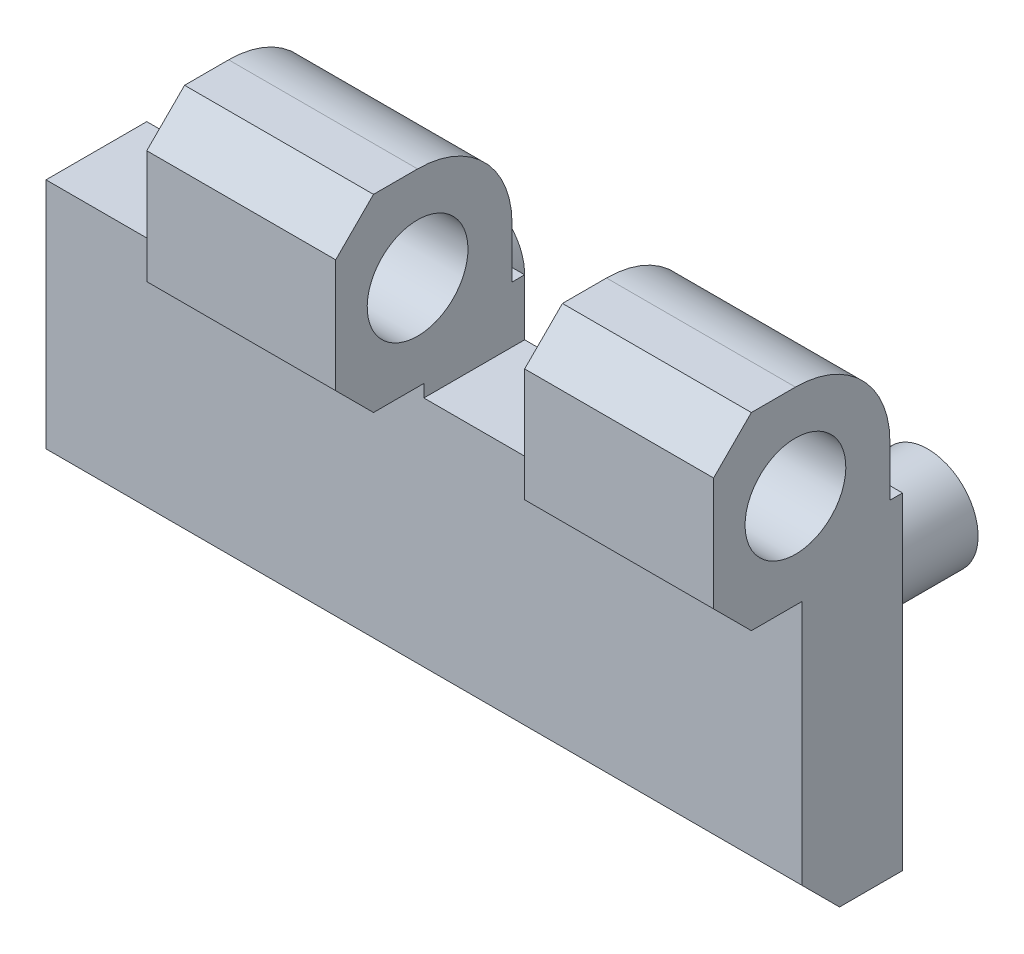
ISO-10303-21;
HEADER;
FILE_DESCRIPTION(('STEP AP214'),'2;1');
FILE_NAME('part.step','',(''),(''),'','','');
FILE_SCHEMA(('AUTOMOTIVE_DESIGN { 1 0 10303 214 1 1 1 1 }'));
ENDSEC;
DATA;
#1=APPLICATION_CONTEXT('core data for automotive mechanical design processes');
#2=APPLICATION_PROTOCOL_DEFINITION('international standard','automotive_design',2000,#1);
#3=PRODUCT_CONTEXT('',#1,'mechanical');
#4=PRODUCT('Part','Part','',(#3));
#5=PRODUCT_RELATED_PRODUCT_CATEGORY('part','',(#4));
#6=PRODUCT_DEFINITION_FORMATION('','',#4);
#7=PRODUCT_DEFINITION_CONTEXT('part definition',#1,'design');
#8=PRODUCT_DEFINITION('design','',#6,#7);
#9=PRODUCT_DEFINITION_SHAPE('','',#8);
#10=(LENGTH_UNIT() NAMED_UNIT(*) SI_UNIT(.MILLI.,.METRE.));
#11=(NAMED_UNIT(*) PLANE_ANGLE_UNIT() SI_UNIT($,.RADIAN.));
#12=(NAMED_UNIT(*) SI_UNIT($,.STERADIAN.) SOLID_ANGLE_UNIT());
#13=UNCERTAINTY_MEASURE_WITH_UNIT(LENGTH_MEASURE(1.E-05),#10,'distance_accuracy_value','');
#14=(GEOMETRIC_REPRESENTATION_CONTEXT(3) GLOBAL_UNCERTAINTY_ASSIGNED_CONTEXT((#13)) GLOBAL_UNIT_ASSIGNED_CONTEXT((#10,
#11,#12)) REPRESENTATION_CONTEXT('',''));
#15=CARTESIAN_POINT('',(0.,0.,0.));
#16=DIRECTION('',(0.,0.,1.));
#17=DIRECTION('',(1.,0.,0.));
#18=AXIS2_PLACEMENT_3D('',#15,#16,#17);
#19=CARTESIAN_POINT('',(-12.,-12.,0.));
#20=DIRECTION('',(0.,0.,-1.));
#21=DIRECTION('',(-1.,0.,0.));
#22=AXIS2_PLACEMENT_3D('',#19,#20,#21);
#23=PLANE('',#22);
#24=DIRECTION('',(-1.,0.,0.));
#25=VECTOR('',#24,1.);
#26=CARTESIAN_POINT('',(-12.,9.5,0.));
#27=LINE('',#26,#25);
#28=CARTESIAN_POINT('',(33.,9.5,0.));
#29=VERTEX_POINT('',#28);
#30=CARTESIAN_POINT('',(18.,9.5,0.));
#31=VERTEX_POINT('',#30);
#32=EDGE_CURVE('E18',#29,#31,#27,.T.);
#33=ORIENTED_EDGE('',*,*,#32,.F.);
#34=DIRECTION('',(0.,1.,0.));
#35=VECTOR('',#34,1.);
#36=CARTESIAN_POINT('',(33.,-12.,0.));
#37=LINE('',#36,#35);
#38=CARTESIAN_POINT('',(33.,13.97,0.));
#39=VERTEX_POINT('',#38);
#40=EDGE_CURVE('E214',#29,#39,#37,.T.);
#41=ORIENTED_EDGE('',*,*,#40,.T.);
#42=DIRECTION('',(1.,0.,0.));
#43=VECTOR('',#42,1.);
#44=CARTESIAN_POINT('',(-12.,13.97,0.));
#45=LINE('',#44,#43);
#46=CARTESIAN_POINT('',(48.,13.97,0.));
#47=VERTEX_POINT('',#46);
#48=EDGE_CURVE('E259',#39,#47,#45,.T.);
#49=ORIENTED_EDGE('',*,*,#48,.T.);
#50=DIRECTION('',(0.,1.,0.));
#51=VECTOR('',#50,1.);
#52=CARTESIAN_POINT('',(48.,-12.,0.));
#53=LINE('',#52,#51);
#54=CARTESIAN_POINT('',(48.,-12.,0.));
#55=VERTEX_POINT('',#54);
#56=EDGE_CURVE('E247',#55,#47,#53,.T.);
#57=ORIENTED_EDGE('',*,*,#56,.F.);
#58=DIRECTION('',(1.,0.,0.));
#59=VECTOR('',#58,1.);
#60=CARTESIAN_POINT('',(-12.,-12.,0.));
#61=LINE('',#60,#59);
#62=CARTESIAN_POINT('',(-12.,-12.,0.));
#63=VERTEX_POINT('',#62);
#64=EDGE_CURVE('E257',#63,#55,#61,.T.);
#65=ORIENTED_EDGE('',*,*,#64,.F.);
#66=DIRECTION('',(0.,1.,0.));
#67=VECTOR('',#66,1.);
#68=CARTESIAN_POINT('',(-12.,-12.,0.));
#69=LINE('',#68,#67);
#70=CARTESIAN_POINT('',(-12.,9.5,0.));
#71=VERTEX_POINT('',#70);
#72=EDGE_CURVE('E208',#63,#71,#69,.T.);
#73=ORIENTED_EDGE('',*,*,#72,.T.);
#74=DIRECTION('',(-1.,0.,0.));
#75=VECTOR('',#74,1.);
#76=CARTESIAN_POINT('',(-12.,9.5,0.));
#77=LINE('',#76,#75);
#78=CARTESIAN_POINT('',(3.,9.5,0.));
#79=VERTEX_POINT('',#78);
#80=EDGE_CURVE('E197',#79,#71,#77,.T.);
#81=ORIENTED_EDGE('',*,*,#80,.F.);
#82=DIRECTION('',(0.,1.,0.));
#83=VECTOR('',#82,1.);
#84=CARTESIAN_POINT('',(3.,-12.,0.));
#85=LINE('',#84,#83);
#86=CARTESIAN_POINT('',(3.,13.97,0.));
#87=VERTEX_POINT('',#86);
#88=EDGE_CURVE('E181',#79,#87,#85,.T.);
#89=ORIENTED_EDGE('',*,*,#88,.T.);
#90=CARTESIAN_POINT('',(18.,13.97,0.));
#91=VERTEX_POINT('',#90);
#92=EDGE_CURVE('E261',#87,#91,#45,.T.);
#93=ORIENTED_EDGE('',*,*,#92,.T.);
#94=DIRECTION('',(0.,1.,0.));
#95=VECTOR('',#94,1.);
#96=CARTESIAN_POINT('',(18.,-12.,0.));
#97=LINE('',#96,#95);
#98=EDGE_CURVE('E319',#31,#91,#97,.T.);
#99=ORIENTED_EDGE('',*,*,#98,.F.);
#100=EDGE_LOOP('',(#33,#41,#49,#57,#65,#73,#81,#89,#93,#99));
#101=FACE_BOUND('',#100,.T.);
#102=CARTESIAN_POINT('',(36.,0.,0.));
#103=DIRECTION('',(0.,0.,-1.));
#104=DIRECTION('',(-1.,0.,0.));
#105=AXIS2_PLACEMENT_3D('',#102,#103,#104);
#106=CIRCLE('',#105,4.);
#107=CARTESIAN_POINT('',(32.,0.,0.));
#108=VERTEX_POINT('',#107);
#109=EDGE_CURVE('E9',#108,#108,#106,.T.);
#110=ORIENTED_EDGE('',*,*,#109,.F.);
#111=EDGE_LOOP('',(#110));
#112=FACE_BOUND('',#111,.T.);
#113=CARTESIAN_POINT('',(0.,0.,0.));
#114=DIRECTION('',(0.,0.,-1.));
#115=DIRECTION('',(-1.,0.,0.));
#116=AXIS2_PLACEMENT_3D('',#113,#114,#115);
#117=CIRCLE('',#116,4.);
#118=CARTESIAN_POINT('',(-4.,0.,0.));
#119=VERTEX_POINT('',#118);
#120=EDGE_CURVE('E489',#119,#119,#117,.T.);
#121=ORIENTED_EDGE('',*,*,#120,.F.);
#122=EDGE_LOOP('',(#121));
#123=FACE_BOUND('',#122,.T.);
#124=ADVANCED_FACE('F14',(#101,#112,#123),#23,.T.);
#125=CARTESIAN_POINT('',(-12.,-12.,8.));
#126=DIRECTION('',(0.,0.,-1.));
#127=DIRECTION('',(0.,1.,0.));
#128=AXIS2_PLACEMENT_3D('',#125,#126,#127);
#129=PLANE('',#128);
#130=DIRECTION('',(0.,1.,0.));
#131=VECTOR('',#130,1.);
#132=CARTESIAN_POINT('',(33.,-12.,8.));
#133=LINE('',#132,#131);
#134=CARTESIAN_POINT('',(33.,9.5,8.));
#135=VERTEX_POINT('',#134);
#136=CARTESIAN_POINT('',(33.,10.5,8.));
#137=VERTEX_POINT('',#136);
#138=EDGE_CURVE('E345',#135,#137,#133,.T.);
#139=ORIENTED_EDGE('',*,*,#138,.F.);
#140=DIRECTION('',(-1.,0.,0.));
#141=VECTOR('',#140,1.);
#142=CARTESIAN_POINT('',(-12.,9.5,8.));
#143=LINE('',#142,#141);
#144=CARTESIAN_POINT('',(18.,9.5,8.));
#145=VERTEX_POINT('',#144);
#146=EDGE_CURVE('E211',#135,#145,#143,.T.);
#147=ORIENTED_EDGE('',*,*,#146,.T.);
#148=DIRECTION('',(0.,1.,0.));
#149=VECTOR('',#148,1.);
#150=CARTESIAN_POINT('',(18.,-12.,8.));
#151=LINE('',#150,#149);
#152=CARTESIAN_POINT('',(18.,10.5,8.));
#153=VERTEX_POINT('',#152);
#154=EDGE_CURVE('E322',#145,#153,#151,.T.);
#155=ORIENTED_EDGE('',*,*,#154,.T.);
#156=DIRECTION('',(1.,0.,0.));
#157=VECTOR('',#156,1.);
#158=CARTESIAN_POINT('',(-12.,10.5,8.));
#159=LINE('',#158,#157);
#160=CARTESIAN_POINT('',(3.,10.5,8.));
#161=VERTEX_POINT('',#160);
#162=EDGE_CURVE('E273',#161,#153,#159,.T.);
#163=ORIENTED_EDGE('',*,*,#162,.F.);
#164=DIRECTION('',(0.,1.,0.));
#165=VECTOR('',#164,1.);
#166=CARTESIAN_POINT('',(3.,-12.,8.));
#167=LINE('',#166,#165);
#168=CARTESIAN_POINT('',(3.,9.5,8.));
#169=VERTEX_POINT('',#168);
#170=EDGE_CURVE('E470',#169,#161,#167,.T.);
#171=ORIENTED_EDGE('',*,*,#170,.F.);
#172=DIRECTION('',(-1.,0.,0.));
#173=VECTOR('',#172,1.);
#174=CARTESIAN_POINT('',(-12.,9.5,8.));
#175=LINE('',#174,#173);
#176=CARTESIAN_POINT('',(-12.,9.5,8.));
#177=VERTEX_POINT('',#176);
#178=EDGE_CURVE('E200',#169,#177,#175,.T.);
#179=ORIENTED_EDGE('',*,*,#178,.T.);
#180=DIRECTION('',(0.,1.,0.));
#181=VECTOR('',#180,1.);
#182=CARTESIAN_POINT('',(-12.,-12.,8.));
#183=LINE('',#182,#181);
#184=CARTESIAN_POINT('',(-12.,-9.,8.));
#185=VERTEX_POINT('',#184);
#186=EDGE_CURVE('E253',#185,#177,#183,.T.);
#187=ORIENTED_EDGE('',*,*,#186,.F.);
#188=DIRECTION('',(1.,0.,0.));
#189=VECTOR('',#188,1.);
#190=CARTESIAN_POINT('',(-12.,-9.,8.));
#191=LINE('',#190,#189);
#192=CARTESIAN_POINT('',(48.,-9.,8.));
#193=VERTEX_POINT('',#192);
#194=EDGE_CURVE('E274',#185,#193,#191,.T.);
#195=ORIENTED_EDGE('',*,*,#194,.T.);
#196=DIRECTION('',(0.,1.,0.));
#197=VECTOR('',#196,1.);
#198=CARTESIAN_POINT('',(48.,-12.,8.));
#199=LINE('',#198,#197);
#200=CARTESIAN_POINT('',(48.,10.5,8.));
#201=VERTEX_POINT('',#200);
#202=EDGE_CURVE('E226',#193,#201,#199,.T.);
#203=ORIENTED_EDGE('',*,*,#202,.T.);
#204=EDGE_CURVE('E271',#137,#201,#159,.T.);
#205=ORIENTED_EDGE('',*,*,#204,.F.);
#206=EDGE_LOOP('',(#139,#147,#155,#163,#171,#179,#187,#195,#203,#205));
#207=FACE_BOUND('',#206,.T.);
#208=ADVANCED_FACE('F16',(#207),#129,.F.);
#209=CARTESIAN_POINT('',(-12.,10.5,15.));
#210=DIRECTION('',(0.,-1.,0.));
#211=DIRECTION('',(0.,0.,-1.));
#212=AXIS2_PLACEMENT_3D('',#209,#210,#211);
#213=PLANE('',#212);
#214=DIRECTION('',(-1.,0.,0.));
#215=VECTOR('',#214,1.);
#216=CARTESIAN_POINT('',(-12.,10.5,12.));
#217=LINE('',#216,#215);
#218=CARTESIAN_POINT('',(48.,10.5,12.));
#219=VERTEX_POINT('',#218);
#220=CARTESIAN_POINT('',(33.,10.5,12.));
#221=VERTEX_POINT('',#220);
#222=EDGE_CURVE('E294',#219,#221,#217,.T.);
#223=ORIENTED_EDGE('',*,*,#222,.T.);
#224=DIRECTION('',(0.,0.,-1.));
#225=VECTOR('',#224,1.);
#226=CARTESIAN_POINT('',(33.,10.5,15.));
#227=LINE('',#226,#225);
#228=EDGE_CURVE('E342',#221,#137,#227,.T.);
#229=ORIENTED_EDGE('',*,*,#228,.T.);
#230=ORIENTED_EDGE('',*,*,#204,.T.);
#231=DIRECTION('',(0.,0.,-1.));
#232=VECTOR('',#231,1.);
#233=CARTESIAN_POINT('',(48.,10.5,15.));
#234=LINE('',#233,#232);
#235=EDGE_CURVE('E229',#219,#201,#234,.T.);
#236=ORIENTED_EDGE('',*,*,#235,.F.);
#237=EDGE_LOOP('',(#223,#229,#230,#236));
#238=FACE_BOUND('',#237,.T.);
#239=ADVANCED_FACE('F379',(#238),#213,.T.);
#240=DIRECTION('',(0.,0.,-1.));
#241=VECTOR('',#240,1.);
#242=CARTESIAN_POINT('',(18.,10.5,15.));
#243=LINE('',#242,#241);
#244=CARTESIAN_POINT('',(18.,10.5,12.));
#245=VERTEX_POINT('',#244);
#246=EDGE_CURVE('E454',#245,#153,#243,.T.);
#247=ORIENTED_EDGE('',*,*,#246,.F.);
#248=CARTESIAN_POINT('',(3.,10.5,12.));
#249=VERTEX_POINT('',#248);
#250=EDGE_CURVE('E298',#245,#249,#217,.T.);
#251=ORIENTED_EDGE('',*,*,#250,.T.);
#252=DIRECTION('',(0.,0.,-1.));
#253=VECTOR('',#252,1.);
#254=CARTESIAN_POINT('',(3.,10.5,15.));
#255=LINE('',#254,#253);
#256=EDGE_CURVE('E472',#249,#161,#255,.T.);
#257=ORIENTED_EDGE('',*,*,#256,.T.);
#258=ORIENTED_EDGE('',*,*,#162,.T.);
#259=EDGE_LOOP('',(#247,#251,#257,#258));
#260=FACE_BOUND('',#259,.T.);
#261=ADVANCED_FACE('F568',(#260),#213,.T.);
#262=CARTESIAN_POINT('',(-12.,10.5,15.));
#263=DIRECTION('',(0.,0.,-1.));
#264=DIRECTION('',(0.,1.,0.));
#265=AXIS2_PLACEMENT_3D('',#262,#263,#264);
#266=PLANE('',#265);
#267=DIRECTION('',(0.,1.,0.));
#268=VECTOR('',#267,1.);
#269=CARTESIAN_POINT('',(33.,10.5,15.));
#270=LINE('',#269,#268);
#271=CARTESIAN_POINT('',(33.,13.5,15.));
#272=VERTEX_POINT('',#271);
#273=CARTESIAN_POINT('',(33.,22.5,15.));
#274=VERTEX_POINT('',#273);
#275=EDGE_CURVE('E335',#272,#274,#270,.T.);
#276=ORIENTED_EDGE('',*,*,#275,.F.);
#277=DIRECTION('',(1.,0.,0.));
#278=VECTOR('',#277,1.);
#279=CARTESIAN_POINT('',(48.,13.5,15.));
#280=LINE('',#279,#278);
#281=CARTESIAN_POINT('',(48.,13.5,15.));
#282=VERTEX_POINT('',#281);
#283=EDGE_CURVE('E291',#272,#282,#280,.T.);
#284=ORIENTED_EDGE('',*,*,#283,.T.);
#285=DIRECTION('',(0.,1.,0.));
#286=VECTOR('',#285,1.);
#287=CARTESIAN_POINT('',(48.,10.5,15.));
#288=LINE('',#287,#286);
#289=CARTESIAN_POINT('',(48.,22.5,15.));
#290=VERTEX_POINT('',#289);
#291=EDGE_CURVE('E232',#282,#290,#288,.T.);
#292=ORIENTED_EDGE('',*,*,#291,.T.);
#293=DIRECTION('',(-1.,0.,0.));
#294=VECTOR('',#293,1.);
#295=CARTESIAN_POINT('',(-12.,22.5,15.));
#296=LINE('',#295,#294);
#297=EDGE_CURVE('E288',#290,#274,#296,.T.);
#298=ORIENTED_EDGE('',*,*,#297,.T.);
#299=EDGE_LOOP('',(#276,#284,#292,#298));
#300=FACE_BOUND('',#299,.T.);
#301=ADVANCED_FACE('F390',(#300),#266,.F.);
#302=CARTESIAN_POINT('',(3.,13.5,15.));
#303=VERTEX_POINT('',#302);
#304=CARTESIAN_POINT('',(18.,13.5,15.));
#305=VERTEX_POINT('',#304);
#306=EDGE_CURVE('E293',#303,#305,#280,.T.);
#307=ORIENTED_EDGE('',*,*,#306,.T.);
#308=DIRECTION('',(0.,1.,0.));
#309=VECTOR('',#308,1.);
#310=CARTESIAN_POINT('',(18.,10.5,15.));
#311=LINE('',#310,#309);
#312=CARTESIAN_POINT('',(18.,22.5,15.));
#313=VERTEX_POINT('',#312);
#314=EDGE_CURVE('E462',#305,#313,#311,.T.);
#315=ORIENTED_EDGE('',*,*,#314,.T.);
#316=CARTESIAN_POINT('',(3.,22.5,15.));
#317=VERTEX_POINT('',#316);
#318=EDGE_CURVE('E287',#313,#317,#296,.T.);
#319=ORIENTED_EDGE('',*,*,#318,.T.);
#320=DIRECTION('',(0.,1.,0.));
#321=VECTOR('',#320,1.);
#322=CARTESIAN_POINT('',(3.,10.5,15.));
#323=LINE('',#322,#321);
#324=EDGE_CURVE('E38',#303,#317,#323,.T.);
#325=ORIENTED_EDGE('',*,*,#324,.F.);
#326=EDGE_LOOP('',(#307,#315,#319,#325));
#327=FACE_BOUND('',#326,.T.);
#328=ADVANCED_FACE('F560',(#327),#266,.F.);
#329=CARTESIAN_POINT('',(-12.,25.5,15.));
#330=DIRECTION('',(0.,-1.,0.));
#331=DIRECTION('',(0.,0.,-1.));
#332=AXIS2_PLACEMENT_3D('',#329,#330,#331);
#333=PLANE('',#332);
#334=DIRECTION('',(0.,0.,-1.));
#335=VECTOR('',#334,1.);
#336=CARTESIAN_POINT('',(33.,25.5,15.));
#337=LINE('',#336,#335);
#338=CARTESIAN_POINT('',(33.,25.5,12.));
#339=VERTEX_POINT('',#338);
#340=CARTESIAN_POINT('',(33.,25.5,8.5));
#341=VERTEX_POINT('',#340);
#342=EDGE_CURVE('E328',#339,#341,#337,.T.);
#343=ORIENTED_EDGE('',*,*,#342,.F.);
#344=DIRECTION('',(1.,0.,0.));
#345=VECTOR('',#344,1.);
#346=CARTESIAN_POINT('',(-12.,25.5,12.));
#347=LINE('',#346,#345);
#348=CARTESIAN_POINT('',(48.,25.5,12.));
#349=VERTEX_POINT('',#348);
#350=EDGE_CURVE('E297',#339,#349,#347,.T.);
#351=ORIENTED_EDGE('',*,*,#350,.T.);
#352=DIRECTION('',(0.,0.,-1.));
#353=VECTOR('',#352,1.);
#354=CARTESIAN_POINT('',(48.,25.5,15.));
#355=LINE('',#354,#353);
#356=CARTESIAN_POINT('',(48.,25.5,8.5));
#357=VERTEX_POINT('',#356);
#358=EDGE_CURVE('E235',#349,#357,#355,.T.);
#359=ORIENTED_EDGE('',*,*,#358,.T.);
#360=DIRECTION('',(1.,0.,0.));
#361=VECTOR('',#360,1.);
#362=CARTESIAN_POINT('',(-12.,25.5,8.5));
#363=LINE('',#362,#361);
#364=EDGE_CURVE('E268',#341,#357,#363,.T.);
#365=ORIENTED_EDGE('',*,*,#364,.F.);
#366=EDGE_LOOP('',(#343,#351,#359,#365));
#367=FACE_BOUND('',#366,.T.);
#368=ADVANCED_FACE('F399',(#367),#333,.F.);
#369=CARTESIAN_POINT('',(3.,25.5,12.));
#370=VERTEX_POINT('',#369);
#371=CARTESIAN_POINT('',(18.,25.5,12.));
#372=VERTEX_POINT('',#371);
#373=EDGE_CURVE('E300',#370,#372,#347,.T.);
#374=ORIENTED_EDGE('',*,*,#373,.T.);
#375=DIRECTION('',(0.,0.,-1.));
#376=VECTOR('',#375,1.);
#377=CARTESIAN_POINT('',(18.,25.5,15.));
#378=LINE('',#377,#376);
#379=CARTESIAN_POINT('',(18.,25.5,8.5));
#380=VERTEX_POINT('',#379);
#381=EDGE_CURVE('E30',#372,#380,#378,.T.);
#382=ORIENTED_EDGE('',*,*,#381,.T.);
#383=CARTESIAN_POINT('',(3.,25.5,8.5));
#384=VERTEX_POINT('',#383);
#385=EDGE_CURVE('E270',#384,#380,#363,.T.);
#386=ORIENTED_EDGE('',*,*,#385,.F.);
#387=DIRECTION('',(0.,0.,-1.));
#388=VECTOR('',#387,1.);
#389=CARTESIAN_POINT('',(3.,25.5,15.));
#390=LINE('',#389,#388);
#391=EDGE_CURVE('E481',#370,#384,#390,.T.);
#392=ORIENTED_EDGE('',*,*,#391,.F.);
#393=EDGE_LOOP('',(#374,#382,#386,#392));
#394=FACE_BOUND('',#393,.T.);
#395=ADVANCED_FACE('F554',(#394),#333,.F.);
#396=CARTESIAN_POINT('',(-12.,18.,8.5));
#397=DIRECTION('',(1.,0.,0.));
#398=DIRECTION('',(0.,1.,0.));
#399=AXIS2_PLACEMENT_3D('',#396,#397,#398);
#400=CYLINDRICAL_SURFACE('',#399,7.5);
#401=CARTESIAN_POINT('',(33.,18.,8.5));
#402=DIRECTION('',(-1.,0.,0.));
#403=DIRECTION('',(0.,-1.,0.));
#404=AXIS2_PLACEMENT_3D('',#401,#402,#403);
#405=CIRCLE('',#404,7.5);
#406=CARTESIAN_POINT('',(33.,18.,1.));
#407=VERTEX_POINT('',#406);
#408=EDGE_CURVE('E340',#341,#407,#405,.T.);
#409=ORIENTED_EDGE('',*,*,#408,.F.);
#410=ORIENTED_EDGE('',*,*,#364,.T.);
#411=CARTESIAN_POINT('',(48.,18.,8.5));
#412=DIRECTION('',(-1.,0.,0.));
#413=DIRECTION('',(0.,-1.,0.));
#414=AXIS2_PLACEMENT_3D('',#411,#412,#413);
#415=CIRCLE('',#414,7.5);
#416=CARTESIAN_POINT('',(48.,18.,1.));
#417=VERTEX_POINT('',#416);
#418=EDGE_CURVE('E238',#357,#417,#415,.T.);
#419=ORIENTED_EDGE('',*,*,#418,.T.);
#420=DIRECTION('',(1.,0.,0.));
#421=VECTOR('',#420,1.);
#422=CARTESIAN_POINT('',(-12.,18.,1.));
#423=LINE('',#422,#421);
#424=EDGE_CURVE('E265',#407,#417,#423,.T.);
#425=ORIENTED_EDGE('',*,*,#424,.F.);
#426=EDGE_LOOP('',(#409,#410,#419,#425));
#427=FACE_BOUND('',#426,.T.);
#428=ADVANCED_FACE('F406',(#427),#400,.T.);
#429=ORIENTED_EDGE('',*,*,#385,.T.);
#430=CARTESIAN_POINT('',(18.,18.,8.5));
#431=DIRECTION('',(-1.,0.,0.));
#432=DIRECTION('',(0.,-1.,0.));
#433=AXIS2_PLACEMENT_3D('',#430,#431,#432);
#434=CIRCLE('',#433,7.5);
#435=CARTESIAN_POINT('',(18.,18.,1.));
#436=VERTEX_POINT('',#435);
#437=EDGE_CURVE('E458',#380,#436,#434,.T.);
#438=ORIENTED_EDGE('',*,*,#437,.T.);
#439=CARTESIAN_POINT('',(3.,18.,1.));
#440=VERTEX_POINT('',#439);
#441=EDGE_CURVE('E267',#440,#436,#423,.T.);
#442=ORIENTED_EDGE('',*,*,#441,.F.);
#443=CARTESIAN_POINT('',(3.,18.,8.5));
#444=DIRECTION('',(-1.,0.,0.));
#445=DIRECTION('',(0.,-1.,0.));
#446=AXIS2_PLACEMENT_3D('',#443,#444,#445);
#447=CIRCLE('',#446,7.5);
#448=EDGE_CURVE('E475',#384,#440,#447,.T.);
#449=ORIENTED_EDGE('',*,*,#448,.F.);
#450=EDGE_LOOP('',(#429,#438,#442,#449));
#451=FACE_BOUND('',#450,.T.);
#452=ADVANCED_FACE('F411',(#451),#400,.T.);
#453=CARTESIAN_POINT('',(-12.,18.,1.));
#454=DIRECTION('',(0.,0.,1.));
#455=DIRECTION('',(0.,-1.,0.));
#456=AXIS2_PLACEMENT_3D('',#453,#454,#455);
#457=PLANE('',#456);
#458=DIRECTION('',(0.,-1.,0.));
#459=VECTOR('',#458,1.);
#460=CARTESIAN_POINT('',(33.,18.,1.));
#461=LINE('',#460,#459);
#462=CARTESIAN_POINT('',(33.,13.97,1.));
#463=VERTEX_POINT('',#462);
#464=EDGE_CURVE('E347',#407,#463,#461,.T.);
#465=ORIENTED_EDGE('',*,*,#464,.F.);
#466=ORIENTED_EDGE('',*,*,#424,.T.);
#467=DIRECTION('',(0.,-1.,0.));
#468=VECTOR('',#467,1.);
#469=CARTESIAN_POINT('',(48.,18.,1.));
#470=LINE('',#469,#468);
#471=CARTESIAN_POINT('',(48.,13.97,1.));
#472=VERTEX_POINT('',#471);
#473=EDGE_CURVE('E241',#417,#472,#470,.T.);
#474=ORIENTED_EDGE('',*,*,#473,.T.);
#475=DIRECTION('',(1.,0.,0.));
#476=VECTOR('',#475,1.);
#477=CARTESIAN_POINT('',(-12.,13.97,1.));
#478=LINE('',#477,#476);
#479=EDGE_CURVE('E262',#463,#472,#478,.T.);
#480=ORIENTED_EDGE('',*,*,#479,.F.);
#481=EDGE_LOOP('',(#465,#466,#474,#480));
#482=FACE_BOUND('',#481,.T.);
#483=ADVANCED_FACE('F408',(#482),#457,.F.);
#484=ORIENTED_EDGE('',*,*,#441,.T.);
#485=DIRECTION('',(0.,-1.,0.));
#486=VECTOR('',#485,1.);
#487=CARTESIAN_POINT('',(18.,18.,1.));
#488=LINE('',#487,#486);
#489=CARTESIAN_POINT('',(18.,13.97,1.));
#490=VERTEX_POINT('',#489);
#491=EDGE_CURVE('E330',#436,#490,#488,.T.);
#492=ORIENTED_EDGE('',*,*,#491,.T.);
#493=CARTESIAN_POINT('',(3.,13.97,1.));
#494=VERTEX_POINT('',#493);
#495=EDGE_CURVE('E264',#494,#490,#478,.T.);
#496=ORIENTED_EDGE('',*,*,#495,.F.);
#497=DIRECTION('',(0.,-1.,0.));
#498=VECTOR('',#497,1.);
#499=CARTESIAN_POINT('',(3.,18.,1.));
#500=LINE('',#499,#498);
#501=EDGE_CURVE('E451',#440,#494,#500,.T.);
#502=ORIENTED_EDGE('',*,*,#501,.F.);
#503=EDGE_LOOP('',(#484,#492,#496,#502));
#504=FACE_BOUND('',#503,.T.);
#505=ADVANCED_FACE('F410',(#504),#457,.F.);
#506=CARTESIAN_POINT('',(-12.,13.97,1.));
#507=DIRECTION('',(0.,-1.,0.));
#508=DIRECTION('',(1.,0.,0.));
#509=AXIS2_PLACEMENT_3D('',#506,#507,#508);
#510=PLANE('',#509);
#511=DIRECTION('',(0.,0.,-1.));
#512=VECTOR('',#511,1.);
#513=CARTESIAN_POINT('',(33.,13.97,1.));
#514=LINE('',#513,#512);
#515=EDGE_CURVE('E349',#463,#39,#514,.T.);
#516=ORIENTED_EDGE('',*,*,#515,.F.);
#517=ORIENTED_EDGE('',*,*,#479,.T.);
#518=DIRECTION('',(0.,0.,-1.));
#519=VECTOR('',#518,1.);
#520=CARTESIAN_POINT('',(48.,13.97,1.));
#521=LINE('',#520,#519);
#522=EDGE_CURVE('E244',#472,#47,#521,.T.);
#523=ORIENTED_EDGE('',*,*,#522,.T.);
#524=ORIENTED_EDGE('',*,*,#48,.F.);
#525=EDGE_LOOP('',(#516,#517,#523,#524));
#526=FACE_BOUND('',#525,.T.);
#527=ADVANCED_FACE('F355',(#526),#510,.F.);
#528=ORIENTED_EDGE('',*,*,#495,.T.);
#529=DIRECTION('',(0.,0.,-1.));
#530=VECTOR('',#529,1.);
#531=CARTESIAN_POINT('',(18.,13.97,1.));
#532=LINE('',#531,#530);
#533=EDGE_CURVE('E325',#490,#91,#532,.T.);
#534=ORIENTED_EDGE('',*,*,#533,.T.);
#535=ORIENTED_EDGE('',*,*,#92,.F.);
#536=DIRECTION('',(0.,0.,-1.));
#537=VECTOR('',#536,1.);
#538=CARTESIAN_POINT('',(3.,13.97,1.));
#539=LINE('',#538,#537);
#540=EDGE_CURVE('E188',#494,#87,#539,.T.);
#541=ORIENTED_EDGE('',*,*,#540,.F.);
#542=EDGE_LOOP('',(#528,#534,#535,#541));
#543=FACE_BOUND('',#542,.T.);
#544=ADVANCED_FACE('F432',(#543),#510,.F.);
#545=CARTESIAN_POINT('',(-12.,18.,8.5));
#546=DIRECTION('',(1.,0.,0.));
#547=DIRECTION('',(0.,1.,0.));
#548=AXIS2_PLACEMENT_3D('',#545,#546,#547);
#549=CYLINDRICAL_SURFACE('',#548,4.);
#550=CARTESIAN_POINT('',(48.,18.,8.5));
#551=DIRECTION('',(1.,0.,0.));
#552=DIRECTION('',(0.,1.,0.));
#553=AXIS2_PLACEMENT_3D('',#550,#551,#552);
#554=CIRCLE('',#553,4.);
#555=CARTESIAN_POINT('',(48.,22.,8.5));
#556=VERTEX_POINT('',#555);
#557=EDGE_CURVE('E220',#556,#556,#554,.T.);
#558=ORIENTED_EDGE('',*,*,#557,.T.);
#559=EDGE_LOOP('',(#558));
#560=FACE_BOUND('',#559,.T.);
#561=CARTESIAN_POINT('',(33.,18.,8.5));
#562=DIRECTION('',(-1.,0.,0.));
#563=DIRECTION('',(0.,-1.,0.));
#564=AXIS2_PLACEMENT_3D('',#561,#562,#563);
#565=CIRCLE('',#564,4.);
#566=CARTESIAN_POINT('',(33.,14.,8.5));
#567=VERTEX_POINT('',#566);
#568=EDGE_CURVE('E209',#567,#567,#565,.F.);
#569=ORIENTED_EDGE('',*,*,#568,.F.);
#570=EDGE_LOOP('',(#569));
#571=FACE_BOUND('',#570,.T.);
#572=ADVANCED_FACE('F437',(#560,#571),#549,.F.);
#573=CARTESIAN_POINT('',(-12.,13.5,15.));
#574=DIRECTION('',(0.,-0.707106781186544,0.707106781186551));
#575=DIRECTION('',(0.,-0.707106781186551,-0.707106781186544));
#576=AXIS2_PLACEMENT_3D('',#573,#574,#575);
#577=PLANE('',#576);
#578=ORIENTED_EDGE('',*,*,#283,.F.);
#579=DIRECTION('',(0.,-0.707106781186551,-0.707106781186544));
#580=VECTOR('',#579,1.);
#581=CARTESIAN_POINT('',(33.,13.5,15.));
#582=LINE('',#581,#580);
#583=EDGE_CURVE('E337',#272,#221,#582,.T.);
#584=ORIENTED_EDGE('',*,*,#583,.T.);
#585=ORIENTED_EDGE('',*,*,#222,.F.);
#586=DIRECTION('',(0.,-0.707106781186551,-0.707106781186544));
#587=VECTOR('',#586,1.);
#588=CARTESIAN_POINT('',(48.,13.5,15.));
#589=LINE('',#588,#587);
#590=EDGE_CURVE('E279',#282,#219,#589,.T.);
#591=ORIENTED_EDGE('',*,*,#590,.F.);
#592=EDGE_LOOP('',(#578,#584,#585,#591));
#593=FACE_BOUND('',#592,.T.);
#594=ADVANCED_FACE('F386',(#593),#577,.T.);
#595=DIRECTION('',(0.,-0.707106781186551,-0.707106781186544));
#596=VECTOR('',#595,1.);
#597=CARTESIAN_POINT('',(18.,13.5,15.));
#598=LINE('',#597,#596);
#599=EDGE_CURVE('E460',#305,#245,#598,.T.);
#600=ORIENTED_EDGE('',*,*,#599,.F.);
#601=ORIENTED_EDGE('',*,*,#306,.F.);
#602=DIRECTION('',(0.,-0.707106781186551,-0.707106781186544));
#603=VECTOR('',#602,1.);
#604=CARTESIAN_POINT('',(3.,13.5,15.));
#605=LINE('',#604,#603);
#606=EDGE_CURVE('E477',#303,#249,#605,.T.);
#607=ORIENTED_EDGE('',*,*,#606,.T.);
#608=ORIENTED_EDGE('',*,*,#250,.F.);
#609=EDGE_LOOP('',(#600,#601,#607,#608));
#610=FACE_BOUND('',#609,.T.);
#611=ADVANCED_FACE('F528',(#610),#577,.T.);
#612=CARTESIAN_POINT('',(-12.,25.5,12.));
#613=DIRECTION('',(0.,-0.707106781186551,-0.707106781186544));
#614=DIRECTION('',(0.,0.707106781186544,-0.707106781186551));
#615=AXIS2_PLACEMENT_3D('',#612,#613,#614);
#616=PLANE('',#615);
#617=ORIENTED_EDGE('',*,*,#350,.F.);
#618=DIRECTION('',(0.,0.707106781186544,-0.707106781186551));
#619=VECTOR('',#618,1.);
#620=CARTESIAN_POINT('',(33.,25.5,12.));
#621=LINE('',#620,#619);
#622=EDGE_CURVE('E305',#339,#274,#621,.F.);
#623=ORIENTED_EDGE('',*,*,#622,.T.);
#624=ORIENTED_EDGE('',*,*,#297,.F.);
#625=DIRECTION('',(0.,0.707106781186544,-0.707106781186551));
#626=VECTOR('',#625,1.);
#627=CARTESIAN_POINT('',(48.,25.5,12.));
#628=LINE('',#627,#626);
#629=EDGE_CURVE('E277',#349,#290,#628,.F.);
#630=ORIENTED_EDGE('',*,*,#629,.F.);
#631=EDGE_LOOP('',(#617,#623,#624,#630));
#632=FACE_BOUND('',#631,.T.);
#633=ADVANCED_FACE('F395',(#632),#616,.F.);
#634=DIRECTION('',(0.,0.707106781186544,-0.707106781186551));
#635=VECTOR('',#634,1.);
#636=CARTESIAN_POINT('',(18.,25.5,12.));
#637=LINE('',#636,#635);
#638=EDGE_CURVE('E303',#372,#313,#637,.F.);
#639=ORIENTED_EDGE('',*,*,#638,.F.);
#640=ORIENTED_EDGE('',*,*,#373,.F.);
#641=DIRECTION('',(0.,0.707106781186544,-0.707106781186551));
#642=VECTOR('',#641,1.);
#643=CARTESIAN_POINT('',(3.,25.5,12.));
#644=LINE('',#643,#642);
#645=EDGE_CURVE('E301',#370,#317,#644,.F.);
#646=ORIENTED_EDGE('',*,*,#645,.T.);
#647=ORIENTED_EDGE('',*,*,#318,.F.);
#648=EDGE_LOOP('',(#639,#640,#646,#647));
#649=FACE_BOUND('',#648,.T.);
#650=ADVANCED_FACE('F527',(#649),#616,.F.);
#651=CARTESIAN_POINT('',(-12.,-12.,0.));
#652=DIRECTION('',(0.,1.,0.));
#653=DIRECTION('',(-1.,0.,0.));
#654=AXIS2_PLACEMENT_3D('',#651,#652,#653);
#655=PLANE('',#654);
#656=DIRECTION('',(0.,0.,1.));
#657=VECTOR('',#656,1.);
#658=CARTESIAN_POINT('',(48.,-12.,0.));
#659=LINE('',#658,#657);
#660=CARTESIAN_POINT('',(48.,-12.,5.));
#661=VERTEX_POINT('',#660);
#662=EDGE_CURVE('E223',#55,#661,#659,.T.);
#663=ORIENTED_EDGE('',*,*,#662,.T.);
#664=DIRECTION('',(-1.,0.,0.));
#665=VECTOR('',#664,1.);
#666=CARTESIAN_POINT('',(-12.,-12.,5.));
#667=LINE('',#666,#665);
#668=CARTESIAN_POINT('',(-12.,-12.,5.));
#669=VERTEX_POINT('',#668);
#670=EDGE_CURVE('E283',#661,#669,#667,.T.);
#671=ORIENTED_EDGE('',*,*,#670,.T.);
#672=DIRECTION('',(0.,0.,1.));
#673=VECTOR('',#672,1.);
#674=CARTESIAN_POINT('',(-12.,-12.,0.));
#675=LINE('',#674,#673);
#676=EDGE_CURVE('E250',#63,#669,#675,.T.);
#677=ORIENTED_EDGE('',*,*,#676,.F.);
#678=ORIENTED_EDGE('',*,*,#64,.T.);
#679=EDGE_LOOP('',(#663,#671,#677,#678));
#680=FACE_BOUND('',#679,.T.);
#681=ADVANCED_FACE('F365',(#680),#655,.F.);
#682=CARTESIAN_POINT('',(-12.,18.,8.5));
#683=DIRECTION('',(-1.,0.,0.));
#684=DIRECTION('',(0.,-1.,0.));
#685=AXIS2_PLACEMENT_3D('',#682,#683,#684);
#686=PLANE('',#685);
#687=DIRECTION('',(0.,0.,1.));
#688=VECTOR('',#687,1.);
#689=CARTESIAN_POINT('',(-12.,9.5,8.5));
#690=LINE('',#689,#688);
#691=EDGE_CURVE('E307',#71,#177,#690,.T.);
#692=ORIENTED_EDGE('',*,*,#691,.F.);
#693=ORIENTED_EDGE('',*,*,#72,.F.);
#694=ORIENTED_EDGE('',*,*,#676,.T.);
#695=DIRECTION('',(0.,-0.707106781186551,-0.707106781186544));
#696=VECTOR('',#695,1.);
#697=CARTESIAN_POINT('',(-12.,4.75000000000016,21.75));
#698=LINE('',#697,#696);
#699=EDGE_CURVE('E285',#669,#185,#698,.F.);
#700=ORIENTED_EDGE('',*,*,#699,.T.);
#701=ORIENTED_EDGE('',*,*,#186,.T.);
#702=EDGE_LOOP('',(#692,#693,#694,#700,#701));
#703=FACE_BOUND('',#702,.T.);
#704=ADVANCED_FACE('F369',(#703),#686,.T.);
#705=CARTESIAN_POINT('',(48.,18.,8.5));
#706=DIRECTION('',(-1.,0.,0.));
#707=DIRECTION('',(0.,-1.,0.));
#708=AXIS2_PLACEMENT_3D('',#705,#706,#707);
#709=PLANE('',#708);
#710=ORIENTED_EDGE('',*,*,#557,.F.);
#711=EDGE_LOOP('',(#710));
#712=FACE_BOUND('',#711,.T.);
#713=ORIENTED_EDGE('',*,*,#202,.F.);
#714=DIRECTION('',(0.,0.707106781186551,0.707106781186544));
#715=VECTOR('',#714,1.);
#716=CARTESIAN_POINT('',(48.,-9.,8.));
#717=LINE('',#716,#715);
#718=EDGE_CURVE('E281',#193,#661,#717,.F.);
#719=ORIENTED_EDGE('',*,*,#718,.T.);
#720=ORIENTED_EDGE('',*,*,#662,.F.);
#721=ORIENTED_EDGE('',*,*,#56,.T.);
#722=ORIENTED_EDGE('',*,*,#522,.F.);
#723=ORIENTED_EDGE('',*,*,#473,.F.);
#724=ORIENTED_EDGE('',*,*,#418,.F.);
#725=ORIENTED_EDGE('',*,*,#358,.F.);
#726=ORIENTED_EDGE('',*,*,#629,.T.);
#727=ORIENTED_EDGE('',*,*,#291,.F.);
#728=ORIENTED_EDGE('',*,*,#590,.T.);
#729=ORIENTED_EDGE('',*,*,#235,.T.);
#730=EDGE_LOOP('',(#713,#719,#720,#721,#722,#723,#724,#725,#726,#727,#728,#729));
#731=FACE_BOUND('',#730,.T.);
#732=ADVANCED_FACE('F362',(#712,#731),#709,.F.);
#733=CARTESIAN_POINT('',(-12.,-9.,8.));
#734=DIRECTION('',(0.,0.707106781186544,-0.707106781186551));
#735=DIRECTION('',(0.,0.707106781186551,0.707106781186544));
#736=AXIS2_PLACEMENT_3D('',#733,#734,#735);
#737=PLANE('',#736);
#738=ORIENTED_EDGE('',*,*,#699,.F.);
#739=ORIENTED_EDGE('',*,*,#670,.F.);
#740=ORIENTED_EDGE('',*,*,#718,.F.);
#741=ORIENTED_EDGE('',*,*,#194,.F.);
#742=EDGE_LOOP('',(#738,#739,#740,#741));
#743=FACE_BOUND('',#742,.T.);
#744=ADVANCED_FACE('F375',(#743),#737,.F.);
#745=CARTESIAN_POINT('',(3.,38.,-5.));
#746=DIRECTION('',(-1.,0.,0.));
#747=DIRECTION('',(0.,-1.,0.));
#748=AXIS2_PLACEMENT_3D('',#745,#746,#747);
#749=PLANE('',#748);
#750=DIRECTION('',(0.,0.,1.));
#751=VECTOR('',#750,1.);
#752=CARTESIAN_POINT('',(3.,9.5,-5.));
#753=LINE('',#752,#751);
#754=EDGE_CURVE('E185',#79,#169,#753,.T.);
#755=ORIENTED_EDGE('',*,*,#754,.T.);
#756=ORIENTED_EDGE('',*,*,#170,.T.);
#757=ORIENTED_EDGE('',*,*,#256,.F.);
#758=ORIENTED_EDGE('',*,*,#606,.F.);
#759=ORIENTED_EDGE('',*,*,#324,.T.);
#760=ORIENTED_EDGE('',*,*,#645,.F.);
#761=ORIENTED_EDGE('',*,*,#391,.T.);
#762=ORIENTED_EDGE('',*,*,#448,.T.);
#763=ORIENTED_EDGE('',*,*,#501,.T.);
#764=ORIENTED_EDGE('',*,*,#540,.T.);
#765=ORIENTED_EDGE('',*,*,#88,.F.);
#766=EDGE_LOOP('',(#755,#756,#757,#758,#759,#760,#761,#762,#763,#764,#765));
#767=FACE_BOUND('',#766,.T.);
#768=CARTESIAN_POINT('',(3.,18.,8.5));
#769=DIRECTION('',(-1.,0.,0.));
#770=DIRECTION('',(0.,-1.,0.));
#771=AXIS2_PLACEMENT_3D('',#768,#769,#770);
#772=CIRCLE('',#771,4.);
#773=CARTESIAN_POINT('',(3.,14.,8.5));
#774=VERTEX_POINT('',#773);
#775=EDGE_CURVE('E193',#774,#774,#772,.F.);
#776=ORIENTED_EDGE('',*,*,#775,.T.);
#777=EDGE_LOOP('',(#776));
#778=FACE_BOUND('',#777,.T.);
#779=ADVANCED_FACE('F183',(#767,#778),#749,.T.);
#780=CARTESIAN_POINT('',(-24.5,9.5,-5.));
#781=DIRECTION('',(0.,-1.,0.));
#782=DIRECTION('',(0.,0.,-1.));
#783=AXIS2_PLACEMENT_3D('',#780,#781,#782);
#784=PLANE('',#783);
#785=ORIENTED_EDGE('',*,*,#754,.F.);
#786=ORIENTED_EDGE('',*,*,#80,.T.);
#787=ORIENTED_EDGE('',*,*,#691,.T.);
#788=ORIENTED_EDGE('',*,*,#178,.F.);
#789=EDGE_LOOP('',(#785,#786,#787,#788));
#790=FACE_BOUND('',#789,.T.);
#791=ADVANCED_FACE('F196',(#790),#784,.F.);
#792=CARTESIAN_POINT('',(18.,9.5,-5.));
#793=DIRECTION('',(0.,-1.,0.));
#794=DIRECTION('',(0.,0.,-1.));
#795=AXIS2_PLACEMENT_3D('',#792,#793,#794);
#796=PLANE('',#795);
#797=DIRECTION('',(0.,0.,1.));
#798=VECTOR('',#797,1.);
#799=CARTESIAN_POINT('',(33.,9.5,-5.));
#800=LINE('',#799,#798);
#801=EDGE_CURVE('E314',#29,#135,#800,.T.);
#802=ORIENTED_EDGE('',*,*,#801,.F.);
#803=ORIENTED_EDGE('',*,*,#32,.T.);
#804=DIRECTION('',(0.,0.,1.));
#805=VECTOR('',#804,1.);
#806=CARTESIAN_POINT('',(18.,9.5,-5.));
#807=LINE('',#806,#805);
#808=EDGE_CURVE('E201',#31,#145,#807,.T.);
#809=ORIENTED_EDGE('',*,*,#808,.T.);
#810=ORIENTED_EDGE('',*,*,#146,.F.);
#811=EDGE_LOOP('',(#802,#803,#809,#810));
#812=FACE_BOUND('',#811,.T.);
#813=ADVANCED_FACE('F312',(#812),#796,.F.);
#814=CARTESIAN_POINT('',(33.,38.,-5.));
#815=DIRECTION('',(-1.,0.,0.));
#816=DIRECTION('',(0.,-1.,0.));
#817=AXIS2_PLACEMENT_3D('',#814,#815,#816);
#818=PLANE('',#817);
#819=ORIENTED_EDGE('',*,*,#801,.T.);
#820=ORIENTED_EDGE('',*,*,#138,.T.);
#821=ORIENTED_EDGE('',*,*,#228,.F.);
#822=ORIENTED_EDGE('',*,*,#583,.F.);
#823=ORIENTED_EDGE('',*,*,#275,.T.);
#824=ORIENTED_EDGE('',*,*,#622,.F.);
#825=ORIENTED_EDGE('',*,*,#342,.T.);
#826=ORIENTED_EDGE('',*,*,#408,.T.);
#827=ORIENTED_EDGE('',*,*,#464,.T.);
#828=ORIENTED_EDGE('',*,*,#515,.T.);
#829=ORIENTED_EDGE('',*,*,#40,.F.);
#830=EDGE_LOOP('',(#819,#820,#821,#822,#823,#824,#825,#826,#827,#828,#829));
#831=FACE_BOUND('',#830,.T.);
#832=ORIENTED_EDGE('',*,*,#568,.T.);
#833=EDGE_LOOP('',(#832));
#834=FACE_BOUND('',#833,.T.);
#835=ADVANCED_FACE('F381',(#831,#834),#818,.T.);
#836=CARTESIAN_POINT('',(18.,38.,-5.));
#837=DIRECTION('',(-1.,0.,0.));
#838=DIRECTION('',(0.,-1.,0.));
#839=AXIS2_PLACEMENT_3D('',#836,#837,#838);
#840=PLANE('',#839);
#841=ORIENTED_EDGE('',*,*,#98,.T.);
#842=ORIENTED_EDGE('',*,*,#533,.F.);
#843=ORIENTED_EDGE('',*,*,#491,.F.);
#844=ORIENTED_EDGE('',*,*,#437,.F.);
#845=ORIENTED_EDGE('',*,*,#381,.F.);
#846=ORIENTED_EDGE('',*,*,#638,.T.);
#847=ORIENTED_EDGE('',*,*,#314,.F.);
#848=ORIENTED_EDGE('',*,*,#599,.T.);
#849=ORIENTED_EDGE('',*,*,#246,.T.);
#850=ORIENTED_EDGE('',*,*,#154,.F.);
#851=ORIENTED_EDGE('',*,*,#808,.F.);
#852=EDGE_LOOP('',(#841,#842,#843,#844,#845,#846,#847,#848,#849,#850,#851));
#853=FACE_BOUND('',#852,.T.);
#854=CARTESIAN_POINT('',(18.,18.,8.5));
#855=DIRECTION('',(-1.,0.,0.));
#856=DIRECTION('',(0.,-1.,0.));
#857=AXIS2_PLACEMENT_3D('',#854,#855,#856);
#858=CIRCLE('',#857,4.);
#859=CARTESIAN_POINT('',(18.,14.,8.5));
#860=VERTEX_POINT('',#859);
#861=EDGE_CURVE('E324',#860,#860,#858,.F.);
#862=ORIENTED_EDGE('',*,*,#861,.F.);
#863=EDGE_LOOP('',(#862));
#864=FACE_BOUND('',#863,.T.);
#865=ADVANCED_FACE('F317',(#853,#864),#840,.F.);
#866=ORIENTED_EDGE('',*,*,#861,.T.);
#867=EDGE_LOOP('',(#866));
#868=FACE_BOUND('',#867,.T.);
#869=ORIENTED_EDGE('',*,*,#775,.F.);
#870=EDGE_LOOP('',(#869));
#871=FACE_BOUND('',#870,.T.);
#872=ADVANCED_FACE('F445',(#868,#871),#549,.F.);
#873=CARTESIAN_POINT('',(36.,0.,-14.));
#874=DIRECTION('',(0.,0.,1.));
#875=DIRECTION('',(1.,0.,0.));
#876=AXIS2_PLACEMENT_3D('',#873,#874,#875);
#877=CYLINDRICAL_SURFACE('',#876,4.);
#878=CARTESIAN_POINT('',(36.,0.,-14.));
#879=DIRECTION('',(0.,0.,-1.));
#880=DIRECTION('',(-1.,0.,0.));
#881=AXIS2_PLACEMENT_3D('',#878,#879,#880);
#882=CIRCLE('',#881,4.);
#883=CARTESIAN_POINT('',(32.,0.,-14.));
#884=VERTEX_POINT('',#883);
#885=EDGE_CURVE('E202',#884,#884,#882,.T.);
#886=ORIENTED_EDGE('',*,*,#885,.F.);
#887=EDGE_LOOP('',(#886));
#888=FACE_BOUND('',#887,.T.);
#889=ORIENTED_EDGE('',*,*,#109,.T.);
#890=EDGE_LOOP('',(#889));
#891=FACE_BOUND('',#890,.T.);
#892=ADVANCED_FACE('F507',(#888,#891),#877,.T.);
#893=CARTESIAN_POINT('',(36.,0.,-14.));
#894=DIRECTION('',(0.,0.,-1.));
#895=DIRECTION('',(-1.,0.,0.));
#896=AXIS2_PLACEMENT_3D('',#893,#894,#895);
#897=PLANE('',#896);
#898=ORIENTED_EDGE('',*,*,#885,.T.);
#899=EDGE_LOOP('',(#898));
#900=FACE_BOUND('',#899,.T.);
#901=ADVANCED_FACE('F497',(#900),#897,.T.);
#902=CARTESIAN_POINT('',(0.,0.,-14.));
#903=DIRECTION('',(0.,0.,1.));
#904=DIRECTION('',(1.,0.,0.));
#905=AXIS2_PLACEMENT_3D('',#902,#903,#904);
#906=CYLINDRICAL_SURFACE('',#905,4.);
#907=CARTESIAN_POINT('',(0.,0.,-14.));
#908=DIRECTION('',(0.,0.,-1.));
#909=DIRECTION('',(-1.,0.,0.));
#910=AXIS2_PLACEMENT_3D('',#907,#908,#909);
#911=CIRCLE('',#910,4.);
#912=CARTESIAN_POINT('',(-4.,0.,-14.));
#913=VERTEX_POINT('',#912);
#914=EDGE_CURVE('E485',#913,#913,#911,.T.);
#915=ORIENTED_EDGE('',*,*,#914,.F.);
#916=EDGE_LOOP('',(#915));
#917=FACE_BOUND('',#916,.T.);
#918=ORIENTED_EDGE('',*,*,#120,.T.);
#919=EDGE_LOOP('',(#918));
#920=FACE_BOUND('',#919,.T.);
#921=ADVANCED_FACE('F493',(#917,#920),#906,.T.);
#922=CARTESIAN_POINT('',(0.,0.,-14.));
#923=DIRECTION('',(0.,0.,-1.));
#924=DIRECTION('',(-1.,0.,0.));
#925=AXIS2_PLACEMENT_3D('',#922,#923,#924);
#926=PLANE('',#925);
#927=ORIENTED_EDGE('',*,*,#914,.T.);
#928=EDGE_LOOP('',(#927));
#929=FACE_BOUND('',#928,.T.);
#930=ADVANCED_FACE('F496',(#929),#926,.T.);
#931=CLOSED_SHELL('',(#124,#208,#239,#261,#301,#328,#368,#395,#428,#452,#483,#505,#527,#544,
#572,#594,#611,#633,#650,#681,#704,#732,#744,#779,#791,#813,#835,#865,#872,#892,#901,#921,#930));
#932=MANIFOLD_SOLID_BREP('B1',#931);
#933=ADVANCED_BREP_SHAPE_REPRESENTATION('',(#18,#932),#14);
#934=SHAPE_DEFINITION_REPRESENTATION(#9,#933);
ENDSEC;
END-ISO-10303-21;
